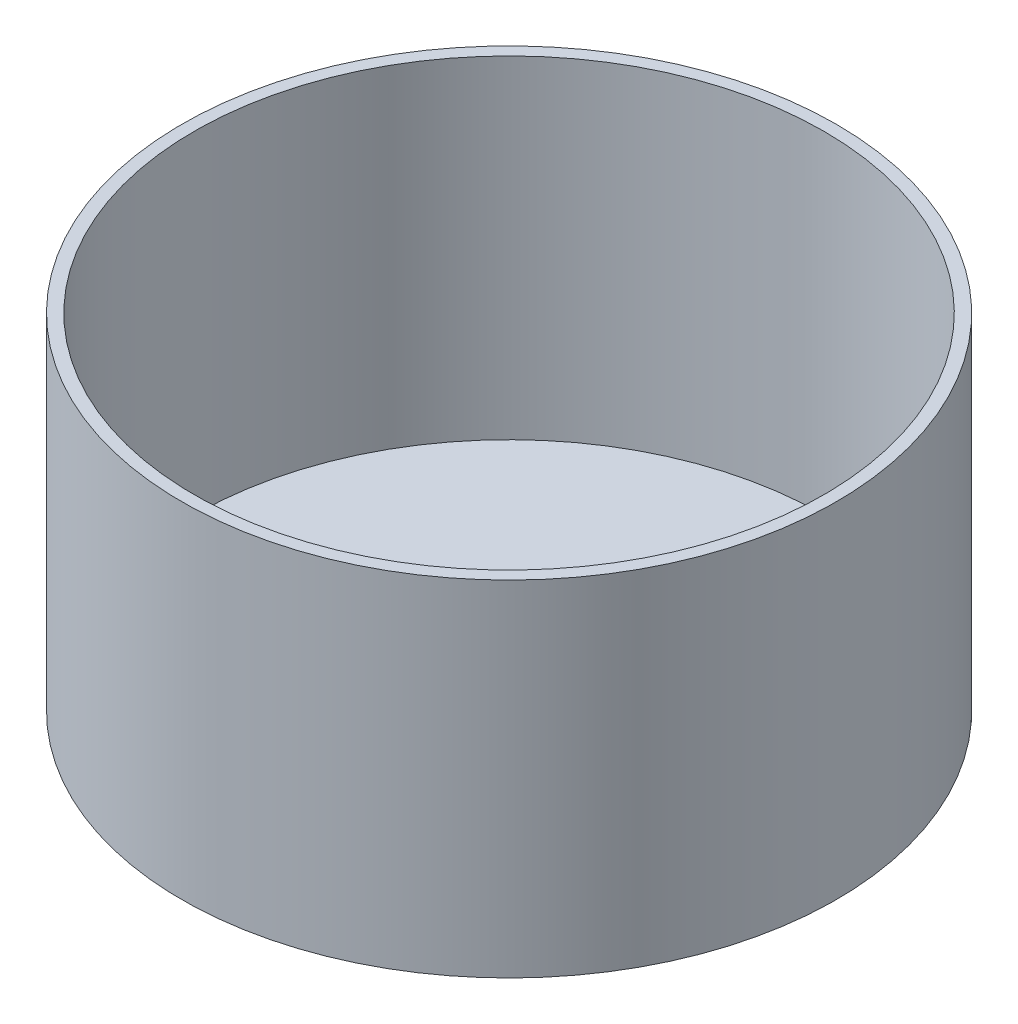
ISO-10303-21;
HEADER;
FILE_DESCRIPTION(('STEP AP214'),'2;1');
FILE_NAME('part.step','',(''),(''),'','','');
FILE_SCHEMA(('AUTOMOTIVE_DESIGN { 1 0 10303 214 1 1 1 1 }'));
ENDSEC;
DATA;
#1=APPLICATION_CONTEXT('core data for automotive mechanical design processes');
#2=APPLICATION_PROTOCOL_DEFINITION('international standard','automotive_design',2000,#1);
#3=PRODUCT_CONTEXT('',#1,'mechanical');
#4=PRODUCT('Part','Part','',(#3));
#5=PRODUCT_RELATED_PRODUCT_CATEGORY('part','',(#4));
#6=PRODUCT_DEFINITION_FORMATION('','',#4);
#7=PRODUCT_DEFINITION_CONTEXT('part definition',#1,'design');
#8=PRODUCT_DEFINITION('design','',#6,#7);
#9=PRODUCT_DEFINITION_SHAPE('','',#8);
#10=(LENGTH_UNIT() NAMED_UNIT(*) SI_UNIT(.MILLI.,.METRE.));
#11=(NAMED_UNIT(*) PLANE_ANGLE_UNIT() SI_UNIT($,.RADIAN.));
#12=(NAMED_UNIT(*) SI_UNIT($,.STERADIAN.) SOLID_ANGLE_UNIT());
#13=UNCERTAINTY_MEASURE_WITH_UNIT(LENGTH_MEASURE(1.E-05),#10,'distance_accuracy_value','');
#14=(GEOMETRIC_REPRESENTATION_CONTEXT(3) GLOBAL_UNCERTAINTY_ASSIGNED_CONTEXT((#13)) GLOBAL_UNIT_ASSIGNED_CONTEXT((#10,
#11,#12)) REPRESENTATION_CONTEXT('',''));
#15=CARTESIAN_POINT('',(0.,0.,0.));
#16=DIRECTION('',(0.,0.,1.));
#17=DIRECTION('',(1.,0.,0.));
#18=AXIS2_PLACEMENT_3D('',#15,#16,#17);
#19=CARTESIAN_POINT('',(-800.,0.,0.));
#20=DIRECTION('',(0.,1.,0.));
#21=DIRECTION('',(0.,0.,1.));
#22=AXIS2_PLACEMENT_3D('',#19,#20,#21);
#23=PLANE('',#22);
#24=CARTESIAN_POINT('',(0.,0.,0.));
#25=DIRECTION('',(0.,-1.,0.));
#26=DIRECTION('',(0.,0.,-1.));
#27=AXIS2_PLACEMENT_3D('',#24,#25,#26);
#28=CIRCLE('',#27,800.);
#29=CARTESIAN_POINT('',(0.,0.,-800.));
#30=VERTEX_POINT('',#29);
#31=EDGE_CURVE('E45',#30,#30,#28,.T.);
#32=ORIENTED_EDGE('',*,*,#31,.T.);
#33=EDGE_LOOP('',(#32));
#34=FACE_BOUND('',#33,.T.);
#35=ADVANCED_FACE('F31',(#34),#23,.F.);
#36=CARTESIAN_POINT('',(-800.,30.,0.));
#37=DIRECTION('',(0.,1.,0.));
#38=DIRECTION('',(0.,0.,1.));
#39=AXIS2_PLACEMENT_3D('',#36,#37,#38);
#40=PLANE('',#39);
#41=CARTESIAN_POINT('',(0.,30.,0.));
#42=DIRECTION('',(0.,-1.,0.));
#43=DIRECTION('',(0.,0.,-1.));
#44=AXIS2_PLACEMENT_3D('',#41,#42,#43);
#45=CIRCLE('',#44,770.);
#46=CARTESIAN_POINT('',(0.,30.,-770.));
#47=VERTEX_POINT('',#46);
#48=EDGE_CURVE('E10',#47,#47,#45,.T.);
#49=ORIENTED_EDGE('',*,*,#48,.F.);
#50=EDGE_LOOP('',(#49));
#51=FACE_BOUND('',#50,.T.);
#52=ADVANCED_FACE('F65',(#51),#40,.T.);
#53=CARTESIAN_POINT('',(0.,0.,0.));
#54=DIRECTION('',(0.,-1.,0.));
#55=DIRECTION('',(0.,0.,-1.));
#56=AXIS2_PLACEMENT_3D('',#53,#54,#55);
#57=CYLINDRICAL_SURFACE('',#56,770.);
#58=ORIENTED_EDGE('',*,*,#48,.T.);
#59=EDGE_LOOP('',(#58));
#60=FACE_BOUND('',#59,.T.);
#61=CARTESIAN_POINT('',(0.,842.790940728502,0.));
#62=DIRECTION('',(0.,-1.,0.));
#63=DIRECTION('',(0.,0.,-1.));
#64=AXIS2_PLACEMENT_3D('',#61,#62,#63);
#65=CIRCLE('',#64,770.);
#66=CARTESIAN_POINT('',(0.,842.790940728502,-770.));
#67=VERTEX_POINT('',#66);
#68=EDGE_CURVE('E37',#67,#67,#65,.T.);
#69=ORIENTED_EDGE('',*,*,#68,.F.);
#70=EDGE_LOOP('',(#69));
#71=FACE_BOUND('',#70,.T.);
#72=ADVANCED_FACE('F60',(#60,#71),#57,.F.);
#73=CARTESIAN_POINT('',(-800.,842.790940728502,0.));
#74=DIRECTION('',(0.,1.,0.));
#75=DIRECTION('',(0.,0.,1.));
#76=AXIS2_PLACEMENT_3D('',#73,#74,#75);
#77=PLANE('',#76);
#78=ORIENTED_EDGE('',*,*,#68,.T.);
#79=EDGE_LOOP('',(#78));
#80=FACE_BOUND('',#79,.T.);
#81=CARTESIAN_POINT('',(0.,842.790940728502,0.));
#82=DIRECTION('',(0.,-1.,0.));
#83=DIRECTION('',(0.,0.,-1.));
#84=AXIS2_PLACEMENT_3D('',#81,#82,#83);
#85=CIRCLE('',#84,800.);
#86=CARTESIAN_POINT('',(0.,842.790940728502,-800.));
#87=VERTEX_POINT('',#86);
#88=EDGE_CURVE('E41',#87,#87,#85,.T.);
#89=ORIENTED_EDGE('',*,*,#88,.F.);
#90=EDGE_LOOP('',(#89));
#91=FACE_BOUND('',#90,.T.);
#92=ADVANCED_FACE('F55',(#80,#91),#77,.T.);
#93=CARTESIAN_POINT('',(0.,0.,0.));
#94=DIRECTION('',(0.,-1.,0.));
#95=DIRECTION('',(0.,0.,-1.));
#96=AXIS2_PLACEMENT_3D('',#93,#94,#95);
#97=CYLINDRICAL_SURFACE('',#96,800.);
#98=ORIENTED_EDGE('',*,*,#31,.F.);
#99=EDGE_LOOP('',(#98));
#100=FACE_BOUND('',#99,.T.);
#101=ORIENTED_EDGE('',*,*,#88,.T.);
#102=EDGE_LOOP('',(#101));
#103=FACE_BOUND('',#102,.T.);
#104=ADVANCED_FACE('F52',(#100,#103),#97,.T.);
#105=CLOSED_SHELL('',(#35,#52,#72,#92,#104));
#106=MANIFOLD_SOLID_BREP('B2',#105);
#107=ADVANCED_BREP_SHAPE_REPRESENTATION('',(#18,#106),#14);
#108=SHAPE_DEFINITION_REPRESENTATION(#9,#107);
ENDSEC;
END-ISO-10303-21;
